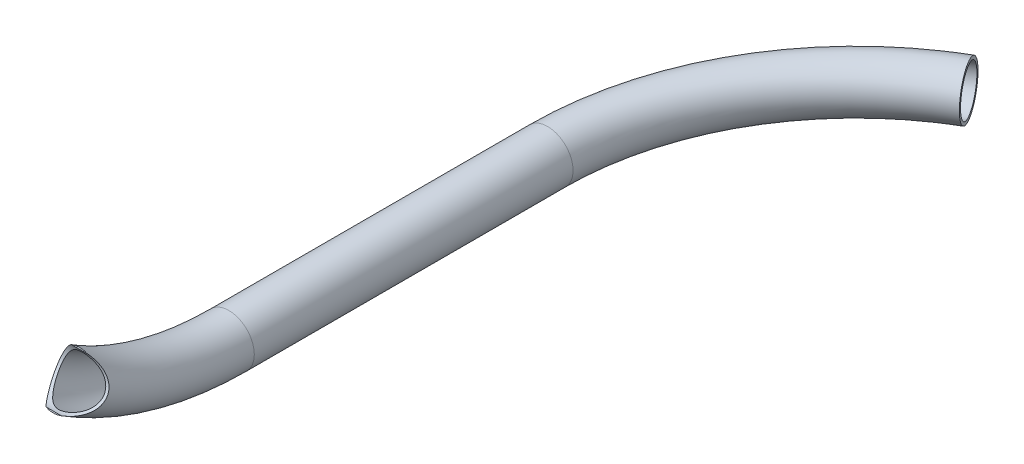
from build123d import *

# Parameters (mm, degrees)
ESQUISSE2_R                  = 16.5
ESQUISSE2_R_2                = 14.5
ESQUISSE2_2_R                = 16.5
ESQUISSE2_2_R_2              = 14.5
ENL_V_MAT_EXTRU_1_DEPTH      = 412.242518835
ENL_V_MAT_EXTRU_1_DEPTH_BACK = 412.242518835
ESQUISSE4_R                  = 16.5


with BuildPart() as part:
    # Balayage1: sweep along a path in Esquisse1
    with BuildLine(Plane(origin=(0, 0, 0), x_dir=(1, 0, 0), z_dir=(0, 1, 0))) as balayage1_path:
        Line((0, 0), (0, 206.794919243))
        ThreePointArc((0, 206.794919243), (26.794919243, 306.794919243), (100, 380))
    # Esquisse2 → Balayage1 (sweep)
    with BuildSketch(Plane.XY):
        Circle(ESQUISSE2_R)
        Circle(ESQUISSE2_R_2, mode=Mode.SUBTRACT)
    sweep(path=balayage1_path.line)

    # Balayage2: sweep along a path in Esquisse3
    with BuildLine(Plane(origin=(0, 0, 0), x_dir=(0, 0, -1), z_dir=(1, 0, 0))) as balayage2_path:
        ThreePointArc((0, 0), (-54.772255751, 7.646159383), (-105.356537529, 30))
    # Esquisse2_2 → Balayage2 (sweep)
    with BuildSketch(Plane.XY):
        Circle(ESQUISSE2_2_R)
        Circle(ESQUISSE2_2_R_2, mode=Mode.SUBTRACT)
    sweep(path=balayage2_path.line)

    # Esquisse4 → Enl_v. mat.-Extru.1 (cut, two sides: drawn at the far end of the back side and taken through both)
    with BuildSketch(Plane(origin=(0, 0, 0), x_dir=(0, 0, -1), z_dir=(1, 0, 0)).offset(-ENL_V_MAT_EXTRU_1_DEPTH_BACK)):
        with Locations((-109.606537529, 32.633913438)):
            Circle(ESQUISSE4_R)
    extrude(amount=ENL_V_MAT_EXTRU_1_DEPTH + ENL_V_MAT_EXTRU_1_DEPTH_BACK, mode=Mode.SUBTRACT)


solid = part.part
